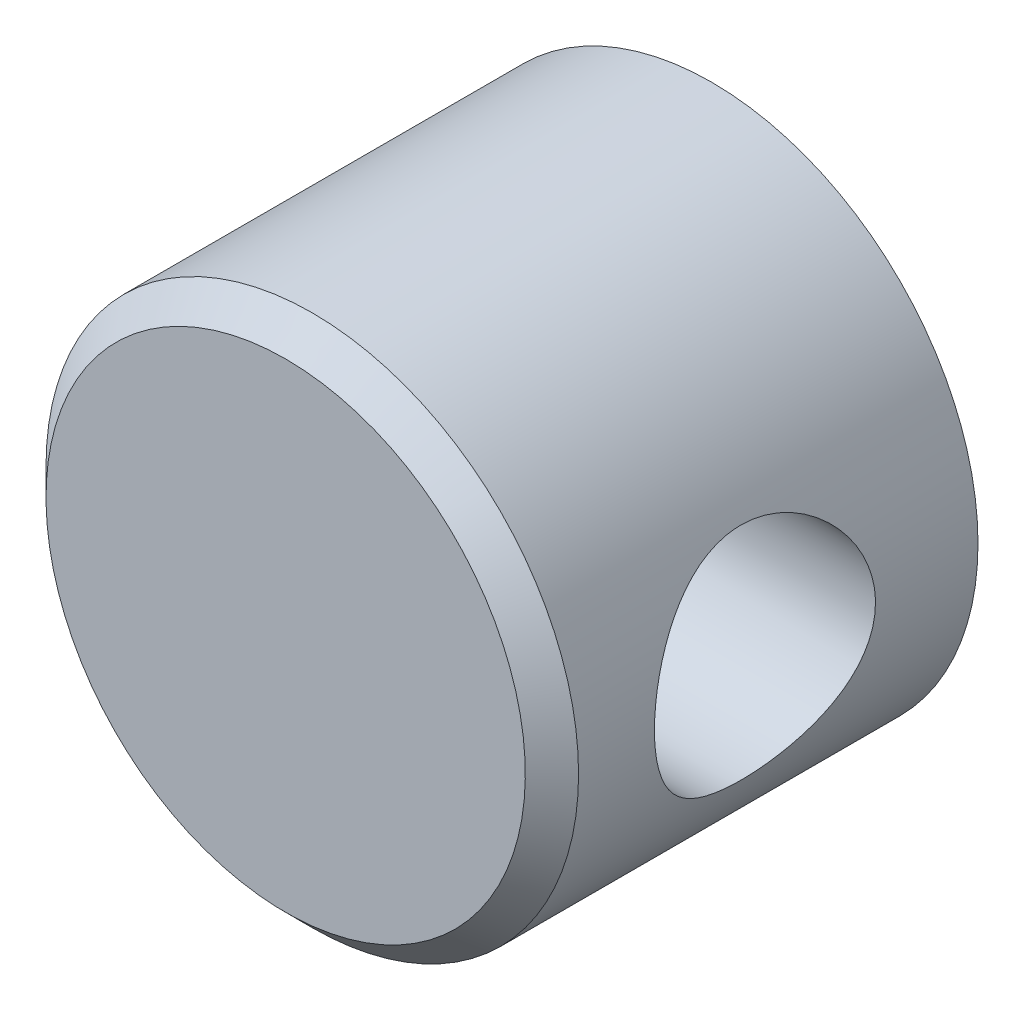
ISO-10303-21;
HEADER;
FILE_DESCRIPTION(('STEP AP214'),'2;1');
FILE_NAME('part.step','',(''),(''),'','','');
FILE_SCHEMA(('AUTOMOTIVE_DESIGN { 1 0 10303 214 1 1 1 1 }'));
ENDSEC;
DATA;
#1=APPLICATION_CONTEXT('core data for automotive mechanical design processes');
#2=APPLICATION_PROTOCOL_DEFINITION('international standard','automotive_design',2000,#1);
#3=PRODUCT_CONTEXT('',#1,'mechanical');
#4=PRODUCT('Part','Part','',(#3));
#5=PRODUCT_RELATED_PRODUCT_CATEGORY('part','',(#4));
#6=PRODUCT_DEFINITION_FORMATION('','',#4);
#7=PRODUCT_DEFINITION_CONTEXT('part definition',#1,'design');
#8=PRODUCT_DEFINITION('design','',#6,#7);
#9=PRODUCT_DEFINITION_SHAPE('','',#8);
#10=(LENGTH_UNIT() NAMED_UNIT(*) SI_UNIT(.MILLI.,.METRE.));
#11=(NAMED_UNIT(*) PLANE_ANGLE_UNIT() SI_UNIT($,.RADIAN.));
#12=(NAMED_UNIT(*) SI_UNIT($,.STERADIAN.) SOLID_ANGLE_UNIT());
#13=UNCERTAINTY_MEASURE_WITH_UNIT(LENGTH_MEASURE(1.E-05),#10,'distance_accuracy_value','');
#14=(GEOMETRIC_REPRESENTATION_CONTEXT(3) GLOBAL_UNCERTAINTY_ASSIGNED_CONTEXT((#13)) GLOBAL_UNIT_ASSIGNED_CONTEXT((#10,
#11,#12)) REPRESENTATION_CONTEXT('',''));
#15=CARTESIAN_POINT('',(0.,0.,0.));
#16=DIRECTION('',(0.,0.,1.));
#17=DIRECTION('',(1.,0.,0.));
#18=AXIS2_PLACEMENT_3D('',#15,#16,#17);
#19=CARTESIAN_POINT('',(0.,0.,8.));
#20=DIRECTION('',(1.,0.,0.));
#21=DIRECTION('',(0.,0.,-1.));
#22=AXIS2_PLACEMENT_3D('',#19,#20,#21);
#23=PLANE('',#22);
#24=CARTESIAN_POINT('',(0.,0.,8.));
#25=DIRECTION('',(1.,0.,0.));
#26=DIRECTION('',(0.,0.,-1.));
#27=AXIS2_PLACEMENT_3D('',#24,#25,#26);
#28=CIRCLE('',#27,4.15);
#29=CARTESIAN_POINT('',(0.,0.,3.85));
#30=VERTEX_POINT('',#29);
#31=EDGE_CURVE('E18',#30,#30,#28,.T.);
#32=ORIENTED_EDGE('',*,*,#31,.T.);
#33=EDGE_LOOP('',(#32));
#34=FACE_BOUND('',#33,.T.);
#35=DIRECTION('',(0.,1.,0.));
#36=VECTOR('',#35,1.);
#37=CARTESIAN_POINT('',(0.,-6.65000000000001,14.65));
#38=LINE('',#37,#36);
#39=CARTESIAN_POINT('',(0.,-6.65000000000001,14.65));
#40=VERTEX_POINT('',#39);
#41=CARTESIAN_POINT('',(0.,6.65,14.65));
#42=VERTEX_POINT('',#41);
#43=EDGE_CURVE('E63',#40,#42,#38,.T.);
#44=ORIENTED_EDGE('',*,*,#43,.T.);
#45=DIRECTION('',(0.,0.,1.));
#46=VECTOR('',#45,1.);
#47=CARTESIAN_POINT('',(0.,6.65,14.65));
#48=LINE('',#47,#46);
#49=CARTESIAN_POINT('',(0.,6.65,1.35));
#50=VERTEX_POINT('',#49);
#51=EDGE_CURVE('E54',#42,#50,#48,.F.);
#52=ORIENTED_EDGE('',*,*,#51,.T.);
#53=DIRECTION('',(0.,1.,0.));
#54=VECTOR('',#53,1.);
#55=CARTESIAN_POINT('',(0.,6.65,1.35));
#56=LINE('',#55,#54);
#57=CARTESIAN_POINT('',(0.,-6.65000000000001,1.35));
#58=VERTEX_POINT('',#57);
#59=EDGE_CURVE('E64',#50,#58,#56,.F.);
#60=ORIENTED_EDGE('',*,*,#59,.T.);
#61=DIRECTION('',(0.,0.,-1.));
#62=VECTOR('',#61,1.);
#63=CARTESIAN_POINT('',(0.,-6.65000000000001,1.35));
#64=LINE('',#63,#62);
#65=EDGE_CURVE('E61',#58,#40,#64,.F.);
#66=ORIENTED_EDGE('',*,*,#65,.T.);
#67=EDGE_LOOP('',(#44,#52,#60,#66));
#68=FACE_BOUND('',#67,.T.);
#69=ADVANCED_FACE('F15',(#34,#68),#23,.F.);
#70=CARTESIAN_POINT('',(0.,0.,16.));
#71=DIRECTION('',(0.,0.,-1.));
#72=DIRECTION('',(-1.,0.,0.));
#73=AXIS2_PLACEMENT_3D('',#70,#71,#72);
#74=PLANE('',#73);
#75=CARTESIAN_POINT('',(0.,0.,16.0000000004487));
#76=DIRECTION('',(0.,0.,-1.));
#77=DIRECTION('',(0.,1.,0.));
#78=AXIS2_PLACEMENT_3D('',#75,#76,#77);
#79=CIRCLE('',#78,9.00000000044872);
#80=CARTESIAN_POINT('',(0.,9.00000000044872,16.0000000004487));
#81=VERTEX_POINT('',#80);
#82=EDGE_CURVE('E115',#81,#81,#79,.T.);
#83=ORIENTED_EDGE('',*,*,#82,.F.);
#84=EDGE_LOOP('',(#83));
#85=FACE_BOUND('',#84,.T.);
#86=ADVANCED_FACE('F142',(#85),#74,.F.);
#87=CARTESIAN_POINT('',(0.,0.,0.));
#88=DIRECTION('',(0.,0.,-1.));
#89=DIRECTION('',(-1.,0.,0.));
#90=AXIS2_PLACEMENT_3D('',#87,#88,#89);
#91=PLANE('',#90);
#92=CARTESIAN_POINT('',(0.,0.,0.));
#93=DIRECTION('',(0.,0.,1.));
#94=DIRECTION('',(1.,0.,0.));
#95=AXIS2_PLACEMENT_3D('',#92,#93,#94);
#96=CIRCLE('',#95,10.);
#97=CARTESIAN_POINT('',(10.,0.,0.));
#98=VERTEX_POINT('',#97);
#99=EDGE_CURVE('E117',#98,#98,#96,.T.);
#100=ORIENTED_EDGE('',*,*,#99,.F.);
#101=EDGE_LOOP('',(#100));
#102=FACE_BOUND('',#101,.T.);
#103=ADVANCED_FACE('F140',(#102),#91,.T.);
#104=CARTESIAN_POINT('',(-10.,-6.65000000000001,14.65));
#105=DIRECTION('',(0.,0.,1.));
#106=DIRECTION('',(1.,0.,0.));
#107=AXIS2_PLACEMENT_3D('',#104,#105,#106);
#108=PLANE('',#107);
#109=DIRECTION('',(1.,0.,0.));
#110=VECTOR('',#109,1.);
#111=CARTESIAN_POINT('',(-10.,6.65,14.65));
#112=LINE('',#111,#110);
#113=CARTESIAN_POINT('',(-7.46843357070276,6.65,14.65));
#114=VERTEX_POINT('',#113);
#115=EDGE_CURVE('E72',#114,#42,#112,.T.);
#116=ORIENTED_EDGE('',*,*,#115,.T.);
#117=ORIENTED_EDGE('',*,*,#43,.F.);
#118=DIRECTION('',(1.,0.,0.));
#119=VECTOR('',#118,1.);
#120=CARTESIAN_POINT('',(-10.,-6.65000000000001,14.65));
#121=LINE('',#120,#119);
#122=CARTESIAN_POINT('',(-7.46843357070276,-6.65,14.65));
#123=VERTEX_POINT('',#122);
#124=EDGE_CURVE('E68',#40,#123,#121,.F.);
#125=ORIENTED_EDGE('',*,*,#124,.T.);
#126=CARTESIAN_POINT('',(0.,0.,14.65));
#127=DIRECTION('',(0.,0.,1.));
#128=DIRECTION('',(1.,0.,0.));
#129=AXIS2_PLACEMENT_3D('',#126,#127,#128);
#130=CIRCLE('',#129,10.);
#131=EDGE_CURVE('E45',#114,#123,#130,.T.);
#132=ORIENTED_EDGE('',*,*,#131,.F.);
#133=EDGE_LOOP('',(#116,#117,#125,#132));
#134=FACE_BOUND('',#133,.T.);
#135=ADVANCED_FACE('F70',(#134),#108,.F.);
#136=CARTESIAN_POINT('',(-10.,-6.65000000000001,1.35));
#137=DIRECTION('',(0.,-1.,0.));
#138=DIRECTION('',(0.,0.,-1.));
#139=AXIS2_PLACEMENT_3D('',#136,#137,#138);
#140=PLANE('',#139);
#141=ORIENTED_EDGE('',*,*,#124,.F.);
#142=ORIENTED_EDGE('',*,*,#65,.F.);
#143=DIRECTION('',(-1.,0.,0.));
#144=VECTOR('',#143,1.);
#145=CARTESIAN_POINT('',(-10.,-6.65,1.35));
#146=LINE('',#145,#144);
#147=CARTESIAN_POINT('',(-7.46843357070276,-6.65,1.35));
#148=VERTEX_POINT('',#147);
#149=EDGE_CURVE('E78',#58,#148,#146,.T.);
#150=ORIENTED_EDGE('',*,*,#149,.T.);
#151=DIRECTION('',(0.,0.,1.));
#152=VECTOR('',#151,1.);
#153=CARTESIAN_POINT('',(-7.46843357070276,-6.65,0.));
#154=LINE('',#153,#152);
#155=EDGE_CURVE('E76',#123,#148,#154,.F.);
#156=ORIENTED_EDGE('',*,*,#155,.F.);
#157=EDGE_LOOP('',(#141,#142,#150,#156));
#158=FACE_BOUND('',#157,.T.);
#159=ADVANCED_FACE('F74',(#158),#140,.F.);
#160=CARTESIAN_POINT('',(-10.,6.65,1.35));
#161=DIRECTION('',(0.,0.,-1.));
#162=DIRECTION('',(-1.,0.,0.));
#163=AXIS2_PLACEMENT_3D('',#160,#161,#162);
#164=PLANE('',#163);
#165=ORIENTED_EDGE('',*,*,#149,.F.);
#166=ORIENTED_EDGE('',*,*,#59,.F.);
#167=DIRECTION('',(1.,0.,0.));
#168=VECTOR('',#167,1.);
#169=CARTESIAN_POINT('',(-10.,6.65,1.35));
#170=LINE('',#169,#168);
#171=CARTESIAN_POINT('',(-7.46843357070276,6.65,1.35));
#172=VERTEX_POINT('',#171);
#173=EDGE_CURVE('E33',#50,#172,#170,.F.);
#174=ORIENTED_EDGE('',*,*,#173,.T.);
#175=CARTESIAN_POINT('',(0.,0.,1.35));
#176=DIRECTION('',(0.,0.,1.));
#177=DIRECTION('',(1.,0.,0.));
#178=AXIS2_PLACEMENT_3D('',#175,#176,#177);
#179=CIRCLE('',#178,10.);
#180=EDGE_CURVE('E92',#148,#172,#179,.F.);
#181=ORIENTED_EDGE('',*,*,#180,.F.);
#182=EDGE_LOOP('',(#165,#166,#174,#181));
#183=FACE_BOUND('',#182,.T.);
#184=ADVANCED_FACE('F130',(#183),#164,.F.);
#185=CARTESIAN_POINT('',(-10.,6.65,14.65));
#186=DIRECTION('',(0.,1.,0.));
#187=DIRECTION('',(0.,0.,1.));
#188=AXIS2_PLACEMENT_3D('',#185,#186,#187);
#189=PLANE('',#188);
#190=ORIENTED_EDGE('',*,*,#173,.F.);
#191=ORIENTED_EDGE('',*,*,#51,.F.);
#192=ORIENTED_EDGE('',*,*,#115,.F.);
#193=DIRECTION('',(0.,0.,1.));
#194=VECTOR('',#193,1.);
#195=CARTESIAN_POINT('',(-7.46843357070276,6.65,0.));
#196=LINE('',#195,#194);
#197=EDGE_CURVE('E91',#172,#114,#196,.T.);
#198=ORIENTED_EDGE('',*,*,#197,.F.);
#199=EDGE_LOOP('',(#190,#191,#192,#198));
#200=FACE_BOUND('',#199,.T.);
#201=ADVANCED_FACE('F109',(#200),#189,.F.);
#202=CARTESIAN_POINT('',(0.,0.,8.));
#203=DIRECTION('',(1.,0.,0.));
#204=DIRECTION('',(0.,0.,-1.));
#205=AXIS2_PLACEMENT_3D('',#202,#203,#204);
#206=CYLINDRICAL_SURFACE('',#205,4.15);
#207=ORIENTED_EDGE('',*,*,#31,.F.);
#208=EDGE_LOOP('',(#207));
#209=FACE_BOUND('',#208,.T.);
#210=CARTESIAN_POINT('',(9.09821411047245,4.15,8.));
#211=CARTESIAN_POINT('',(9.09821491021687,4.14999921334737,7.88923104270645));
#212=CARTESIAN_POINT('',(9.10024411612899,4.14555846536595,7.77842189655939));
#213=CARTESIAN_POINT('',(9.1082938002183,4.12784149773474,7.55761043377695));
#214=CARTESIAN_POINT('',(9.11431689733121,4.11455948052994,7.4476086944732));
#215=CARTESIAN_POINT('',(9.13016869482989,4.07926413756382,7.22904156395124));
#216=CARTESIAN_POINT('',(9.14000551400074,4.05723218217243,7.1204797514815));
#217=CARTESIAN_POINT('',(9.16315247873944,4.0046787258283,6.90579470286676));
#218=CARTESIAN_POINT('',(9.17646408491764,3.97415365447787,6.79967251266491));
#219=CARTESIAN_POINT('',(9.22086905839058,3.87056343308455,6.48698699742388));
#220=CARTESIAN_POINT('',(9.25652215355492,3.78529603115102,6.28496545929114));
#221=CARTESIAN_POINT('',(9.33588969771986,3.58506499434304,5.89825863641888));
#222=CARTESIAN_POINT('',(9.37960219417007,3.47010854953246,5.71356916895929));
#223=CARTESIAN_POINT('',(9.47318940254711,3.20614064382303,5.35511870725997));
#224=CARTESIAN_POINT('',(9.52327207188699,3.05558334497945,5.18254779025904));
#225=CARTESIAN_POINT('',(9.62224507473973,2.72794267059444,4.86423233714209));
#226=CARTESIAN_POINT('',(9.67113494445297,2.55084916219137,4.71849809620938));
#227=CARTESIAN_POINT('',(9.76473735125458,2.1658161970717,4.45192201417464));
#228=CARTESIAN_POINT('',(9.80918013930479,1.95687832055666,4.33241878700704));
#229=CARTESIAN_POINT('',(9.88633930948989,1.51968805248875,4.13077245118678));
#230=CARTESIAN_POINT('',(9.91906085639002,1.29144422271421,4.0486128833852));
#231=CARTESIAN_POINT('',(9.96761694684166,0.834630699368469,3.92829777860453));
#232=CARTESIAN_POINT('',(9.98423672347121,0.606687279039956,3.88808779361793));
#233=CARTESIAN_POINT('',(10.0015675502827,0.146723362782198,3.84617736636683));
#234=CARTESIAN_POINT('',(10.0022849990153,-0.0852954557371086,3.84446143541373));
#235=CARTESIAN_POINT('',(9.98819421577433,-0.531894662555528,3.8785061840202));
#236=CARTESIAN_POINT('',(9.97432084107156,-0.746682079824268,3.91201020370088));
#237=CARTESIAN_POINT('',(9.9338886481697,-1.16726539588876,4.01167844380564));
#238=CARTESIAN_POINT('',(9.90732889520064,-1.37306063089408,4.07784507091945));
#239=CARTESIAN_POINT('',(9.84358541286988,-1.77358752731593,4.24175020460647));
#240=CARTESIAN_POINT('',(9.80624589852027,-1.96810270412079,4.33995463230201));
#241=CARTESIAN_POINT('',(9.72460203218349,-2.33840157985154,4.56469330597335));
#242=CARTESIAN_POINT('',(9.68029522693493,-2.51417864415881,4.69123753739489));
#243=CARTESIAN_POINT('',(9.58550731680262,-2.85508544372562,4.97936832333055));
#244=CARTESIAN_POINT('',(9.53481111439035,-3.01860843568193,5.14278783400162));
#245=CARTESIAN_POINT('',(9.43529428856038,-3.31661855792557,5.49485270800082));
#246=CARTESIAN_POINT('',(9.3864743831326,-3.45109466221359,5.68350760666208));
#247=CARTESIAN_POINT('',(9.29470931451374,-3.6912715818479,6.0884126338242));
#248=CARTESIAN_POINT('',(9.25200558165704,-3.79589957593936,6.30535853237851));
#249=CARTESIAN_POINT('',(9.18017866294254,-3.96648303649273,6.75603358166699));
#250=CARTESIAN_POINT('',(9.15104586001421,-4.03246589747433,6.98975071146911));
#251=CARTESIAN_POINT('',(9.11203906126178,-4.11981823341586,7.45124061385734));
#252=CARTESIAN_POINT('',(9.10104391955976,-4.14379112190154,7.67842423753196));
#253=CARTESIAN_POINT('',(9.09635329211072,-4.15408419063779,8.13378511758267));
#254=CARTESIAN_POINT('',(9.10265190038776,-4.14041722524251,8.36196200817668));
#255=CARTESIAN_POINT('',(9.1306815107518,-4.07819387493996,8.79762003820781));
#256=CARTESIAN_POINT('',(9.15141059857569,-4.03190031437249,9.00549703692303));
#257=CARTESIAN_POINT('',(9.20468896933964,-3.90872993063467,9.4103654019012));
#258=CARTESIAN_POINT('',(9.23724100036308,-3.83184599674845,9.60735422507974));
#259=CARTESIAN_POINT('',(9.31217093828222,-3.64607685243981,9.99413847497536));
#260=CARTESIAN_POINT('',(9.35490539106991,-3.53597859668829,10.1832799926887));
#261=CARTESIAN_POINT('',(9.44487463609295,-3.2881162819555,10.5413077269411));
#262=CARTESIAN_POINT('',(9.49211136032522,-3.15034031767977,10.7101851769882));
#263=CARTESIAN_POINT('',(9.59035944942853,-2.83793665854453,11.0370613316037));
#264=CARTESIAN_POINT('',(9.64136805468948,-2.66123326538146,11.1930848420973));
#265=CARTESIAN_POINT('',(9.73787049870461,-2.28296667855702,11.4736150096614));
#266=CARTESIAN_POINT('',(9.78336395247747,-2.08140175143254,11.5981194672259));
#267=CARTESIAN_POINT('',(9.86398873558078,-1.65778697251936,11.8119053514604));
#268=CARTESIAN_POINT('',(9.89909647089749,-1.43569195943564,11.9011067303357));
#269=CARTESIAN_POINT('',(9.95474362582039,-0.97781867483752,12.0402386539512));
#270=CARTESIAN_POINT('',(9.97529163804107,-0.742048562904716,12.0901923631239));
#271=CARTESIAN_POINT('',(9.99852293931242,-0.281181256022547,12.1465105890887));
#272=CARTESIAN_POINT('',(10.0023475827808,-0.0564796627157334,12.1556608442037));
#273=CARTESIAN_POINT('',(9.99485172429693,0.391173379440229,12.1375882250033));
#274=CARTESIAN_POINT('',(9.98353384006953,0.614125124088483,12.1103716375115));
#275=CARTESIAN_POINT('',(9.94762153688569,1.04391559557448,12.0223375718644));
#276=CARTESIAN_POINT('',(9.92350536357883,1.25104515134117,11.9627287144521));
#277=CARTESIAN_POINT('',(9.86463863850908,1.65229033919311,11.8129155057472));
#278=CARTESIAN_POINT('',(9.82988605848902,1.8464034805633,11.722705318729));
#279=CARTESIAN_POINT('',(9.75116718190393,2.225749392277,11.5096984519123));
#280=CARTESIAN_POINT('',(9.70685594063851,2.4101864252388,11.3856152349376));
#281=CARTESIAN_POINT('',(9.61428029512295,2.75640767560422,11.1102530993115));
#282=CARTESIAN_POINT('',(9.56601444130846,2.91818352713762,10.958964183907));
#283=CARTESIAN_POINT('',(9.46688929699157,3.22581257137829,10.6214960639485));
#284=CARTESIAN_POINT('',(9.41607450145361,3.36985735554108,10.4336524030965));
#285=CARTESIAN_POINT('',(9.32096012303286,3.62467862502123,10.0347327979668));
#286=CARTESIAN_POINT('',(9.27666417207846,3.73543660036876,9.82364401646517));
#287=CARTESIAN_POINT('',(9.21951847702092,3.87335982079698,9.49455430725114));
#288=CARTESIAN_POINT('',(9.20204940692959,3.91456886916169,9.38305417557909));
#289=CARTESIAN_POINT('',(9.17073617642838,3.9873770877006,9.15648320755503));
#290=CARTESIAN_POINT('',(9.15689024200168,4.01898096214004,9.04141414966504));
#291=CARTESIAN_POINT('',(9.13337080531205,4.07214694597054,8.80889642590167));
#292=CARTESIAN_POINT('',(9.12368628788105,4.09373557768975,8.69145491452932));
#293=CARTESIAN_POINT('',(9.10881736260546,4.1267151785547,8.45492608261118));
#294=CARTESIAN_POINT('',(9.10362944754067,4.13811409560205,8.33584011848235));
#295=CARTESIAN_POINT('',(9.09993150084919,4.14623296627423,8.18043700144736));
#296=CARTESIAN_POINT('',(9.09928789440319,4.14764520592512,8.1443685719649));
#297=CARTESIAN_POINT('',(9.09842906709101,4.14952885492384,8.07220151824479));
#298=CARTESIAN_POINT('',(9.09821384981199,4.15000025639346,8.03610289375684));
#299=CARTESIAN_POINT('',(9.09821411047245,4.15,8.));
#300=B_SPLINE_CURVE_WITH_KNOTS('',3,(#210,#211,#212,#213,#214,#215,#216,#217,#218,#219,#220,
#221,#222,#223,#224,#225,#226,#227,#228,#229,#230,#231,#232,#233,#234,#235,#236,#237,#238,#239,
#240,#241,#242,#243,#244,#245,#246,#247,#248,#249,#250,#251,#252,#253,#254,#255,#256,#257,#258,
#259,#260,#261,#262,#263,#264,#265,#266,#267,#268,#269,#270,#271,#272,#273,#274,#275,#276,#277,
#278,#279,#280,#281,#282,#283,#284,#285,#286,#287,#288,#289,#290,#291,#292,#293,#294,#295,#296,
#297,#298,#299),.UNSPECIFIED.,.T.,.F.,(4,2,2,2,2,2,2,2,2,2,2,2,2,2,2,2,2,2,2,2,2,2,2,2,2,2,2,2,
2,2,2,2,2,2,2,2,2,2,2,2,2,2,2,2,4),(0.,0.332268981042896,0.66475605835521,0.997954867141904,
1.33129396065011,1.99454193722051,2.65762943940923,3.35782669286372,4.05829200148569,
4.78885444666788,5.51909458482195,6.21160098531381,6.90382873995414,7.55425833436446,
8.20473586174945,8.86512960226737,9.52575639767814,10.2326293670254,10.9397701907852,
11.6698098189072,12.3993313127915,13.081791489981,13.7640186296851,14.4030689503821,
15.0422679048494,15.7084287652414,16.3748767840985,17.0950628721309,17.8152992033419,
18.537159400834,19.2585932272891,19.9299350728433,20.6011608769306,21.2489079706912,
21.8967786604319,22.5738782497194,23.251227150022,23.9742349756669,24.6976441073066,
25.057684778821,25.4175488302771,25.7764543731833,26.1350797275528,26.2433751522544,
26.3516714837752),.UNSPECIFIED.);
#301=CARTESIAN_POINT('',(9.09821411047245,4.15,8.));
#302=VERTEX_POINT('',#301);
#303=EDGE_CURVE('E24',#302,#302,#300,.T.);
#304=ORIENTED_EDGE('',*,*,#303,.F.);
#305=EDGE_LOOP('',(#304));
#306=FACE_BOUND('',#305,.T.);
#307=ADVANCED_FACE('F94',(#209,#306),#206,.F.);
#308=CARTESIAN_POINT('',(0.,0.,14.9999999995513));
#309=DIRECTION('',(0.,0.,-1.));
#310=DIRECTION('',(0.,1.,0.));
#311=AXIS2_PLACEMENT_3D('',#308,#309,#310);
#312=CONICAL_SURFACE('',#311,9.99999999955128,0.7853981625);
#313=CARTESIAN_POINT('',(0.,0.,15.));
#314=DIRECTION('',(0.,0.,1.));
#315=DIRECTION('',(1.,0.,0.));
#316=AXIS2_PLACEMENT_3D('',#313,#314,#315);
#317=CIRCLE('',#316,10.);
#318=CARTESIAN_POINT('',(10.,0.,15.));
#319=VERTEX_POINT('',#318);
#320=EDGE_CURVE('E10',#319,#319,#317,.F.);
#321=ORIENTED_EDGE('',*,*,#320,.F.);
#322=EDGE_LOOP('',(#321));
#323=FACE_BOUND('',#322,.T.);
#324=ORIENTED_EDGE('',*,*,#82,.T.);
#325=EDGE_LOOP('',(#324));
#326=FACE_BOUND('',#325,.T.);
#327=ADVANCED_FACE('F101',(#323,#326),#312,.T.);
#328=CARTESIAN_POINT('',(0.,0.,0.));
#329=DIRECTION('',(0.,0.,1.));
#330=DIRECTION('',(1.,0.,0.));
#331=AXIS2_PLACEMENT_3D('',#328,#329,#330);
#332=CYLINDRICAL_SURFACE('',#331,10.);
#333=ORIENTED_EDGE('',*,*,#320,.T.);
#334=EDGE_LOOP('',(#333));
#335=FACE_BOUND('',#334,.T.);
#336=ORIENTED_EDGE('',*,*,#303,.T.);
#337=EDGE_LOOP('',(#336));
#338=FACE_BOUND('',#337,.T.);
#339=ORIENTED_EDGE('',*,*,#180,.T.);
#340=ORIENTED_EDGE('',*,*,#197,.T.);
#341=ORIENTED_EDGE('',*,*,#131,.T.);
#342=ORIENTED_EDGE('',*,*,#155,.T.);
#343=EDGE_LOOP('',(#339,#340,#341,#342));
#344=FACE_BOUND('',#343,.T.);
#345=ORIENTED_EDGE('',*,*,#99,.T.);
#346=EDGE_LOOP('',(#345));
#347=FACE_BOUND('',#346,.T.);
#348=ADVANCED_FACE('F98',(#335,#338,#344,#347),#332,.T.);
#349=CLOSED_SHELL('',(#69,#86,#103,#135,#159,#184,#201,#307,#327,#348));
#350=MANIFOLD_SOLID_BREP('B1',#349);
#351=ADVANCED_BREP_SHAPE_REPRESENTATION('',(#18,#350),#14);
#352=SHAPE_DEFINITION_REPRESENTATION(#9,#351);
ENDSEC;
END-ISO-10303-21;
